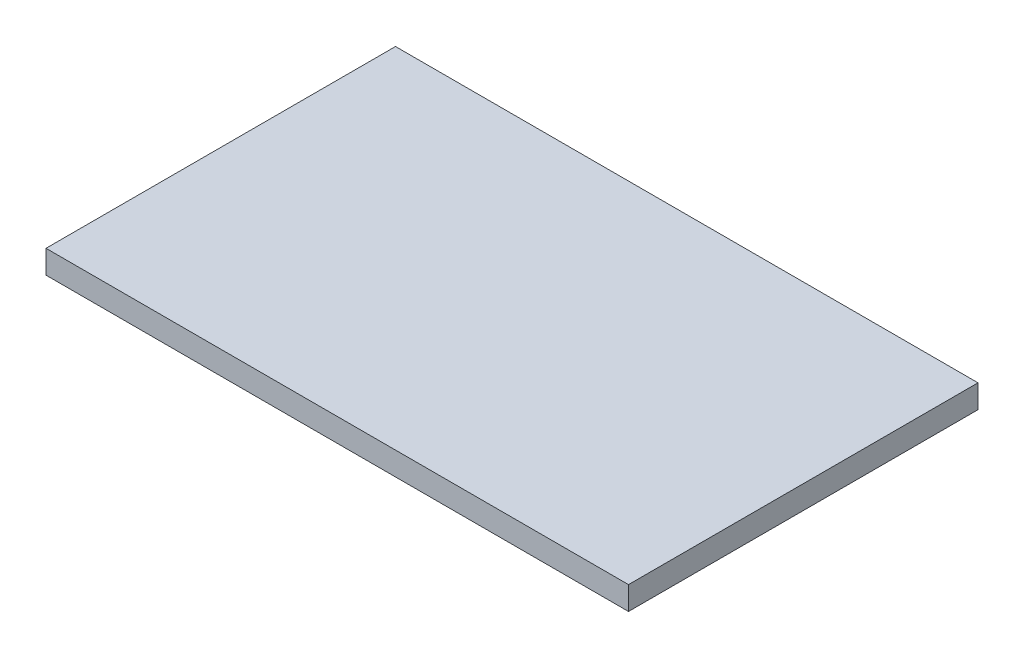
from build123d import *

# Parameters (mm, degrees)
SKETCH1_W      = 100
SKETCH1_H      = 60
EXTRUDE1_DEPTH = 4


with BuildPart() as part:
    # Sketch1 → Extrude1 (new body)
    with BuildSketch(Plane(origin=(0, 0, 0), x_dir=(1, 0, 0), z_dir=(0, 1, 0))):
        with Locations((50, 30)):
            Rectangle(SKETCH1_W, SKETCH1_H)
    extrude(amount=EXTRUDE1_DEPTH)


solid = part.part
